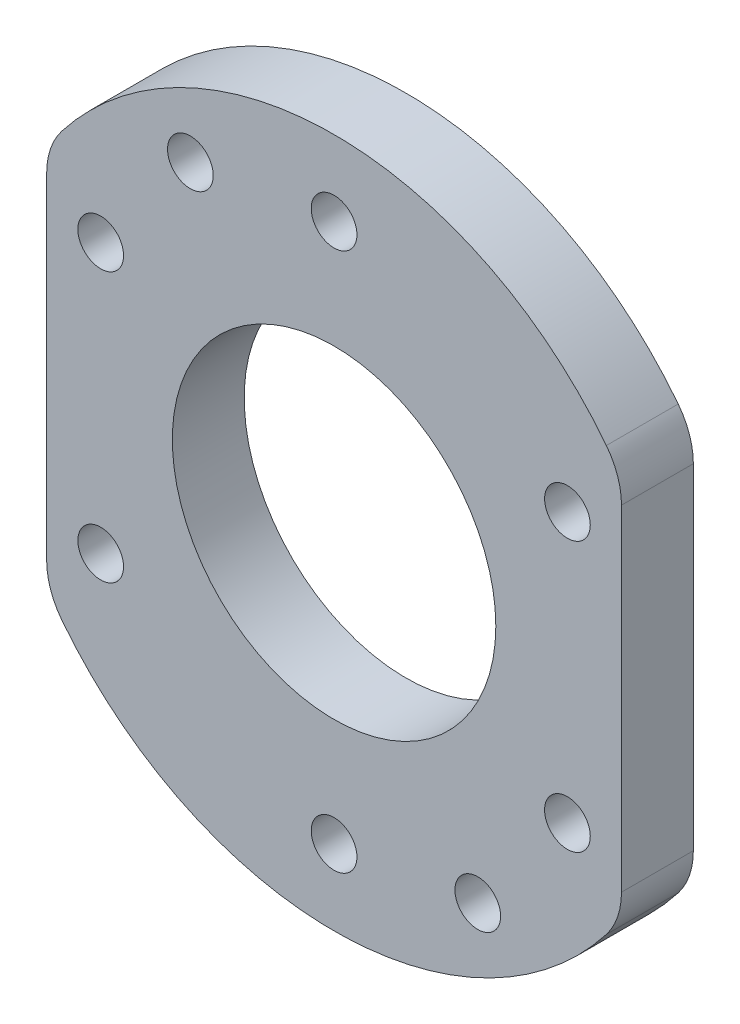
ISO-10303-21;
HEADER;
FILE_DESCRIPTION(('STEP AP214'),'2;1');
FILE_NAME('part.step','',(''),(''),'','','');
FILE_SCHEMA(('AUTOMOTIVE_DESIGN { 1 0 10303 214 1 1 1 1 }'));
ENDSEC;
DATA;
#1=APPLICATION_CONTEXT('core data for automotive mechanical design processes');
#2=APPLICATION_PROTOCOL_DEFINITION('international standard','automotive_design',2000,#1);
#3=PRODUCT_CONTEXT('',#1,'mechanical');
#4=PRODUCT('Part','Part','',(#3));
#5=PRODUCT_RELATED_PRODUCT_CATEGORY('part','',(#4));
#6=PRODUCT_DEFINITION_FORMATION('','',#4);
#7=PRODUCT_DEFINITION_CONTEXT('part definition',#1,'design');
#8=PRODUCT_DEFINITION('design','',#6,#7);
#9=PRODUCT_DEFINITION_SHAPE('','',#8);
#10=(LENGTH_UNIT() NAMED_UNIT(*) SI_UNIT(.MILLI.,.METRE.));
#11=(NAMED_UNIT(*) PLANE_ANGLE_UNIT() SI_UNIT($,.RADIAN.));
#12=(NAMED_UNIT(*) SI_UNIT($,.STERADIAN.) SOLID_ANGLE_UNIT());
#13=UNCERTAINTY_MEASURE_WITH_UNIT(LENGTH_MEASURE(1.E-05),#10,'distance_accuracy_value','');
#14=(GEOMETRIC_REPRESENTATION_CONTEXT(3) GLOBAL_UNCERTAINTY_ASSIGNED_CONTEXT((#13)) GLOBAL_UNIT_ASSIGNED_CONTEXT((#10,
#11,#12)) REPRESENTATION_CONTEXT('',''));
#15=CARTESIAN_POINT('',(0.,0.,0.));
#16=DIRECTION('',(0.,0.,1.));
#17=DIRECTION('',(1.,0.,0.));
#18=AXIS2_PLACEMENT_3D('',#15,#16,#17);
#19=CARTESIAN_POINT('',(25.4,0.,6.35));
#20=DIRECTION('',(1.,0.,0.));
#21=DIRECTION('',(0.,1.,0.));
#22=AXIS2_PLACEMENT_3D('',#19,#20,#21);
#23=PLANE('',#22);
#24=DIRECTION('',(0.,-1.,0.));
#25=VECTOR('',#24,1.);
#26=CARTESIAN_POINT('',(25.4,0.,0.));
#27=LINE('',#26,#25);
#28=CARTESIAN_POINT('',(25.4,14.8106178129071,0.));
#29=VERTEX_POINT('',#28);
#30=CARTESIAN_POINT('',(25.4,-14.8106178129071,0.));
#31=VERTEX_POINT('',#30);
#32=EDGE_CURVE('E130',#29,#31,#27,.T.);
#33=ORIENTED_EDGE('',*,*,#32,.F.);
#34=DIRECTION('',(0.,0.,1.));
#35=VECTOR('',#34,1.);
#36=CARTESIAN_POINT('',(25.4,14.8106178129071,6.35));
#37=LINE('',#36,#35);
#38=CARTESIAN_POINT('',(25.4,14.8106178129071,6.35));
#39=VERTEX_POINT('',#38);
#40=EDGE_CURVE('E108',#29,#39,#37,.T.);
#41=ORIENTED_EDGE('',*,*,#40,.T.);
#42=DIRECTION('',(0.,-1.,0.));
#43=VECTOR('',#42,1.);
#44=CARTESIAN_POINT('',(25.4,0.,6.35));
#45=LINE('',#44,#43);
#46=CARTESIAN_POINT('',(25.4,-14.8106178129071,6.35));
#47=VERTEX_POINT('',#46);
#48=EDGE_CURVE('E137',#39,#47,#45,.T.);
#49=ORIENTED_EDGE('',*,*,#48,.T.);
#50=DIRECTION('',(0.,0.,1.));
#51=VECTOR('',#50,1.);
#52=CARTESIAN_POINT('',(25.4,-14.8106178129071,0.));
#53=LINE('',#52,#51);
#54=EDGE_CURVE('E113',#47,#31,#53,.F.);
#55=ORIENTED_EDGE('',*,*,#54,.T.);
#56=EDGE_LOOP('',(#33,#41,#49,#55));
#57=FACE_BOUND('',#56,.T.);
#58=ADVANCED_FACE('F37',(#57),#23,.T.);
#59=CARTESIAN_POINT('',(0.,0.,6.35));
#60=DIRECTION('',(0.,0.,-1.));
#61=DIRECTION('',(-1.,0.,0.));
#62=AXIS2_PLACEMENT_3D('',#59,#60,#61);
#63=CYLINDRICAL_SURFACE('',#62,30.48);
#64=CARTESIAN_POINT('',(0.,0.,6.35));
#65=DIRECTION('',(0.,0.,1.));
#66=DIRECTION('',(1.,0.,0.));
#67=AXIS2_PLACEMENT_3D('',#64,#65,#66);
#68=CIRCLE('',#67,30.48);
#69=CARTESIAN_POINT('',(24.0631578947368,18.7081488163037,6.35));
#70=VERTEX_POINT('',#69);
#71=CARTESIAN_POINT('',(-24.0631578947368,18.7081488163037,6.35));
#72=VERTEX_POINT('',#71);
#73=EDGE_CURVE('E123',#70,#72,#68,.T.);
#74=ORIENTED_EDGE('',*,*,#73,.F.);
#75=DIRECTION('',(0.,0.,-1.));
#76=VECTOR('',#75,1.);
#77=CARTESIAN_POINT('',(24.0631578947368,18.7081488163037,6.35));
#78=LINE('',#77,#76);
#79=CARTESIAN_POINT('',(24.0631578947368,18.7081488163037,0.));
#80=VERTEX_POINT('',#79);
#81=EDGE_CURVE('E107',#70,#80,#78,.T.);
#82=ORIENTED_EDGE('',*,*,#81,.T.);
#83=CARTESIAN_POINT('',(0.,0.,0.));
#84=DIRECTION('',(0.,0.,1.));
#85=DIRECTION('',(1.,0.,0.));
#86=AXIS2_PLACEMENT_3D('',#83,#84,#85);
#87=CIRCLE('',#86,30.48);
#88=CARTESIAN_POINT('',(-24.0631578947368,18.7081488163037,0.));
#89=VERTEX_POINT('',#88);
#90=EDGE_CURVE('E120',#80,#89,#87,.T.);
#91=ORIENTED_EDGE('',*,*,#90,.T.);
#92=DIRECTION('',(0.,0.,-1.));
#93=VECTOR('',#92,1.);
#94=CARTESIAN_POINT('',(-24.0631578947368,18.7081488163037,6.35));
#95=LINE('',#94,#93);
#96=EDGE_CURVE('E125',#89,#72,#95,.F.);
#97=ORIENTED_EDGE('',*,*,#96,.T.);
#98=EDGE_LOOP('',(#74,#82,#91,#97));
#99=FACE_BOUND('',#98,.T.);
#100=ADVANCED_FACE('F119',(#99),#63,.T.);
#101=CARTESIAN_POINT('',(-25.4,0.,6.35));
#102=DIRECTION('',(1.,0.,0.));
#103=DIRECTION('',(0.,0.,-1.));
#104=AXIS2_PLACEMENT_3D('',#101,#102,#103);
#105=PLANE('',#104);
#106=DIRECTION('',(0.,-1.,0.));
#107=VECTOR('',#106,1.);
#108=CARTESIAN_POINT('',(-25.4,0.,0.));
#109=LINE('',#108,#107);
#110=CARTESIAN_POINT('',(-25.4,14.8106178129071,0.));
#111=VERTEX_POINT('',#110);
#112=CARTESIAN_POINT('',(-25.4,-14.8106178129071,0.));
#113=VERTEX_POINT('',#112);
#114=EDGE_CURVE('E129',#111,#113,#109,.T.);
#115=ORIENTED_EDGE('',*,*,#114,.T.);
#116=DIRECTION('',(0.,0.,-1.));
#117=VECTOR('',#116,1.);
#118=CARTESIAN_POINT('',(-25.4,-14.8106178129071,6.35));
#119=LINE('',#118,#117);
#120=CARTESIAN_POINT('',(-25.4,-14.8106178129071,6.35));
#121=VERTEX_POINT('',#120);
#122=EDGE_CURVE('E11',#113,#121,#119,.F.);
#123=ORIENTED_EDGE('',*,*,#122,.T.);
#124=DIRECTION('',(0.,-1.,0.));
#125=VECTOR('',#124,1.);
#126=CARTESIAN_POINT('',(-25.4,0.,6.35));
#127=LINE('',#126,#125);
#128=CARTESIAN_POINT('',(-25.4,14.8106178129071,6.35));
#129=VERTEX_POINT('',#128);
#130=EDGE_CURVE('E146',#129,#121,#127,.T.);
#131=ORIENTED_EDGE('',*,*,#130,.F.);
#132=DIRECTION('',(0.,0.,-1.));
#133=VECTOR('',#132,1.);
#134=CARTESIAN_POINT('',(-25.4,14.8106178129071,6.35));
#135=LINE('',#134,#133);
#136=EDGE_CURVE('E45',#129,#111,#135,.T.);
#137=ORIENTED_EDGE('',*,*,#136,.T.);
#138=EDGE_LOOP('',(#115,#123,#131,#137));
#139=FACE_BOUND('',#138,.T.);
#140=ADVANCED_FACE('F173',(#139),#105,.F.);
#141=CARTESIAN_POINT('',(-24.0631578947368,-18.7081488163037,0.));
#142=VERTEX_POINT('',#141);
#143=CARTESIAN_POINT('',(24.0631578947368,-18.7081488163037,0.));
#144=VERTEX_POINT('',#143);
#145=EDGE_CURVE('E132',#142,#144,#87,.T.);
#146=ORIENTED_EDGE('',*,*,#145,.T.);
#147=DIRECTION('',(0.,0.,-1.));
#148=VECTOR('',#147,1.);
#149=CARTESIAN_POINT('',(24.0631578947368,-18.7081488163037,6.35));
#150=LINE('',#149,#148);
#151=CARTESIAN_POINT('',(24.0631578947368,-18.7081488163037,6.35));
#152=VERTEX_POINT('',#151);
#153=EDGE_CURVE('E52',#144,#152,#150,.F.);
#154=ORIENTED_EDGE('',*,*,#153,.T.);
#155=CARTESIAN_POINT('',(-24.0631578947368,-18.7081488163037,6.35));
#156=VERTEX_POINT('',#155);
#157=EDGE_CURVE('E148',#156,#152,#68,.T.);
#158=ORIENTED_EDGE('',*,*,#157,.F.);
#159=DIRECTION('',(0.,0.,-1.));
#160=VECTOR('',#159,1.);
#161=CARTESIAN_POINT('',(-24.0631578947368,-18.7081488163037,6.35));
#162=LINE('',#161,#160);
#163=EDGE_CURVE('E163',#156,#142,#162,.T.);
#164=ORIENTED_EDGE('',*,*,#163,.T.);
#165=EDGE_LOOP('',(#146,#154,#158,#164));
#166=FACE_BOUND('',#165,.T.);
#167=ADVANCED_FACE('F197',(#166),#63,.T.);
#168=CARTESIAN_POINT('',(0.,0.,6.35));
#169=DIRECTION('',(0.,0.,1.));
#170=DIRECTION('',(1.,0.,0.));
#171=AXIS2_PLACEMENT_3D('',#168,#169,#170);
#172=PLANE('',#171);
#173=CARTESIAN_POINT('',(-12.7,21.9970452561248,6.35));
#174=DIRECTION('',(0.,0.,1.));
#175=DIRECTION('',(1.,0.,0.));
#176=AXIS2_PLACEMENT_3D('',#173,#174,#175);
#177=CIRCLE('',#176,2.01929999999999);
#178=CARTESIAN_POINT('',(-10.6807,21.9970452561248,6.35));
#179=VERTEX_POINT('',#178);
#180=EDGE_CURVE('E250',#179,#179,#177,.T.);
#181=ORIENTED_EDGE('',*,*,#180,.F.);
#182=EDGE_LOOP('',(#181));
#183=FACE_BOUND('',#182,.T.);
#184=CARTESIAN_POINT('',(12.7,-21.9970452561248,6.35));
#185=DIRECTION('',(0.,0.,1.));
#186=DIRECTION('',(1.,0.,0.));
#187=AXIS2_PLACEMENT_3D('',#184,#185,#186);
#188=CIRCLE('',#187,2.01929999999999);
#189=CARTESIAN_POINT('',(14.7192999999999,-21.9970452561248,6.35));
#190=VERTEX_POINT('',#189);
#191=EDGE_CURVE('E252',#190,#190,#188,.T.);
#192=ORIENTED_EDGE('',*,*,#191,.F.);
#193=EDGE_LOOP('',(#192));
#194=FACE_BOUND('',#193,.T.);
#195=CARTESIAN_POINT('',(0.,0.,6.35));
#196=DIRECTION('',(0.,0.,1.));
#197=DIRECTION('',(1.,0.,0.));
#198=AXIS2_PLACEMENT_3D('',#195,#196,#197);
#199=CIRCLE('',#198,14.29385);
#200=CARTESIAN_POINT('',(14.29385,0.,6.35));
#201=VERTEX_POINT('',#200);
#202=EDGE_CURVE('E260',#201,#201,#199,.T.);
#203=ORIENTED_EDGE('',*,*,#202,.F.);
#204=EDGE_LOOP('',(#203));
#205=FACE_BOUND('',#204,.T.);
#206=CARTESIAN_POINT('',(-20.6222299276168,11.9062500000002,6.35));
#207=DIRECTION('',(0.,0.,1.));
#208=DIRECTION('',(1.,0.,0.));
#209=AXIS2_PLACEMENT_3D('',#206,#207,#208);
#210=CIRCLE('',#209,2.01929999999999);
#211=CARTESIAN_POINT('',(-18.6029299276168,11.9062500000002,6.35));
#212=VERTEX_POINT('',#211);
#213=EDGE_CURVE('E264',#212,#212,#210,.T.);
#214=ORIENTED_EDGE('',*,*,#213,.F.);
#215=EDGE_LOOP('',(#214));
#216=FACE_BOUND('',#215,.T.);
#217=CARTESIAN_POINT('',(-20.6222299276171,-11.9062499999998,6.35));
#218=DIRECTION('',(0.,0.,1.));
#219=DIRECTION('',(1.,0.,0.));
#220=AXIS2_PLACEMENT_3D('',#217,#218,#219);
#221=CIRCLE('',#220,2.01929999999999);
#222=CARTESIAN_POINT('',(-18.6029299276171,-11.9062499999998,6.35));
#223=VERTEX_POINT('',#222);
#224=EDGE_CURVE('E272',#223,#223,#221,.T.);
#225=ORIENTED_EDGE('',*,*,#224,.F.);
#226=EDGE_LOOP('',(#225));
#227=FACE_BOUND('',#226,.T.);
#228=CARTESIAN_POINT('',(0.,-23.8125,6.35));
#229=DIRECTION('',(0.,0.,1.));
#230=DIRECTION('',(1.,0.,0.));
#231=AXIS2_PLACEMENT_3D('',#228,#229,#230);
#232=CIRCLE('',#231,2.01929999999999);
#233=CARTESIAN_POINT('',(2.01929999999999,-23.8125,6.35));
#234=VERTEX_POINT('',#233);
#235=EDGE_CURVE('E278',#234,#234,#232,.T.);
#236=ORIENTED_EDGE('',*,*,#235,.F.);
#237=EDGE_LOOP('',(#236));
#238=FACE_BOUND('',#237,.T.);
#239=CARTESIAN_POINT('',(20.6222299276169,-11.9062500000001,6.35));
#240=DIRECTION('',(0.,0.,1.));
#241=DIRECTION('',(1.,0.,0.));
#242=AXIS2_PLACEMENT_3D('',#239,#240,#241);
#243=CIRCLE('',#242,2.01929999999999);
#244=CARTESIAN_POINT('',(22.6415299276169,-11.9062500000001,6.35));
#245=VERTEX_POINT('',#244);
#246=EDGE_CURVE('E284',#245,#245,#243,.T.);
#247=ORIENTED_EDGE('',*,*,#246,.F.);
#248=EDGE_LOOP('',(#247));
#249=FACE_BOUND('',#248,.T.);
#250=CARTESIAN_POINT('',(20.622229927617,11.90625,6.35));
#251=DIRECTION('',(0.,0.,1.));
#252=DIRECTION('',(1.,0.,0.));
#253=AXIS2_PLACEMENT_3D('',#250,#251,#252);
#254=CIRCLE('',#253,2.01929999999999);
#255=CARTESIAN_POINT('',(22.641529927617,11.90625,6.35));
#256=VERTEX_POINT('',#255);
#257=EDGE_CURVE('E290',#256,#256,#254,.T.);
#258=ORIENTED_EDGE('',*,*,#257,.F.);
#259=EDGE_LOOP('',(#258));
#260=FACE_BOUND('',#259,.T.);
#261=CARTESIAN_POINT('',(0.,23.8125,6.35));
#262=DIRECTION('',(0.,0.,1.));
#263=DIRECTION('',(1.,0.,0.));
#264=AXIS2_PLACEMENT_3D('',#261,#262,#263);
#265=CIRCLE('',#264,2.01929999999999);
#266=CARTESIAN_POINT('',(2.01929999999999,23.8125,6.35));
#267=VERTEX_POINT('',#266);
#268=EDGE_CURVE('E295',#267,#267,#265,.T.);
#269=ORIENTED_EDGE('',*,*,#268,.F.);
#270=EDGE_LOOP('',(#269));
#271=FACE_BOUND('',#270,.T.);
#272=ORIENTED_EDGE('',*,*,#48,.F.);
#273=CARTESIAN_POINT('',(19.05,14.8106178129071,6.35));
#274=DIRECTION('',(0.,0.,1.));
#275=DIRECTION('',(1.,0.,0.));
#276=AXIS2_PLACEMENT_3D('',#273,#274,#275);
#277=CIRCLE('',#276,6.35);
#278=EDGE_CURVE('E166',#39,#70,#277,.T.);
#279=ORIENTED_EDGE('',*,*,#278,.T.);
#280=ORIENTED_EDGE('',*,*,#73,.T.);
#281=CARTESIAN_POINT('',(-19.05,14.8106178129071,6.35));
#282=DIRECTION('',(0.,0.,1.));
#283=DIRECTION('',(1.,0.,0.));
#284=AXIS2_PLACEMENT_3D('',#281,#282,#283);
#285=CIRCLE('',#284,6.35);
#286=EDGE_CURVE('E155',#72,#129,#285,.T.);
#287=ORIENTED_EDGE('',*,*,#286,.T.);
#288=ORIENTED_EDGE('',*,*,#130,.T.);
#289=CARTESIAN_POINT('',(-19.05,-14.8106178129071,6.35));
#290=DIRECTION('',(0.,0.,1.));
#291=DIRECTION('',(1.,0.,0.));
#292=AXIS2_PLACEMENT_3D('',#289,#290,#291);
#293=CIRCLE('',#292,6.35);
#294=EDGE_CURVE('E59',#121,#156,#293,.T.);
#295=ORIENTED_EDGE('',*,*,#294,.T.);
#296=ORIENTED_EDGE('',*,*,#157,.T.);
#297=CARTESIAN_POINT('',(19.05,-14.8106178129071,6.35));
#298=DIRECTION('',(0.,0.,1.));
#299=DIRECTION('',(1.,0.,0.));
#300=AXIS2_PLACEMENT_3D('',#297,#298,#299);
#301=CIRCLE('',#300,6.35);
#302=EDGE_CURVE('E164',#152,#47,#301,.T.);
#303=ORIENTED_EDGE('',*,*,#302,.T.);
#304=EDGE_LOOP('',(#272,#279,#280,#287,#288,#295,#296,#303));
#305=FACE_BOUND('',#304,.T.);
#306=ADVANCED_FACE('F153',(#183,#194,#205,#216,#227,#238,#249,#260,#271,#305),#172,.T.);
#307=CARTESIAN_POINT('',(0.,0.,0.));
#308=DIRECTION('',(0.,0.,1.));
#309=DIRECTION('',(1.,0.,0.));
#310=AXIS2_PLACEMENT_3D('',#307,#308,#309);
#311=PLANE('',#310);
#312=CARTESIAN_POINT('',(-12.7,21.9970452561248,0.));
#313=DIRECTION('',(0.,0.,1.));
#314=DIRECTION('',(1.,0.,0.));
#315=AXIS2_PLACEMENT_3D('',#312,#313,#314);
#316=CIRCLE('',#315,2.0193);
#317=CARTESIAN_POINT('',(-10.6807,21.9970452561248,0.));
#318=VERTEX_POINT('',#317);
#319=EDGE_CURVE('E247',#318,#318,#316,.T.);
#320=ORIENTED_EDGE('',*,*,#319,.T.);
#321=EDGE_LOOP('',(#320));
#322=FACE_BOUND('',#321,.T.);
#323=CARTESIAN_POINT('',(12.7,-21.9970452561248,0.));
#324=DIRECTION('',(0.,0.,1.));
#325=DIRECTION('',(1.,0.,0.));
#326=AXIS2_PLACEMENT_3D('',#323,#324,#325);
#327=CIRCLE('',#326,2.0193);
#328=CARTESIAN_POINT('',(14.7193,-21.9970452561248,0.));
#329=VERTEX_POINT('',#328);
#330=EDGE_CURVE('E257',#329,#329,#327,.T.);
#331=ORIENTED_EDGE('',*,*,#330,.T.);
#332=EDGE_LOOP('',(#331));
#333=FACE_BOUND('',#332,.T.);
#334=CARTESIAN_POINT('',(0.,0.,0.));
#335=DIRECTION('',(0.,0.,1.));
#336=DIRECTION('',(1.,0.,0.));
#337=AXIS2_PLACEMENT_3D('',#334,#335,#336);
#338=CIRCLE('',#337,14.29385);
#339=CARTESIAN_POINT('',(14.29385,0.,0.));
#340=VERTEX_POINT('',#339);
#341=EDGE_CURVE('E261',#340,#340,#338,.T.);
#342=ORIENTED_EDGE('',*,*,#341,.T.);
#343=EDGE_LOOP('',(#342));
#344=FACE_BOUND('',#343,.T.);
#345=CARTESIAN_POINT('',(-20.6222299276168,11.9062500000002,0.));
#346=DIRECTION('',(0.,0.,1.));
#347=DIRECTION('',(1.,0.,0.));
#348=AXIS2_PLACEMENT_3D('',#345,#346,#347);
#349=CIRCLE('',#348,2.0193);
#350=CARTESIAN_POINT('',(-18.6029299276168,11.9062500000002,0.));
#351=VERTEX_POINT('',#350);
#352=EDGE_CURVE('E269',#351,#351,#349,.T.);
#353=ORIENTED_EDGE('',*,*,#352,.T.);
#354=EDGE_LOOP('',(#353));
#355=FACE_BOUND('',#354,.T.);
#356=CARTESIAN_POINT('',(-20.6222299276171,-11.9062499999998,0.));
#357=DIRECTION('',(0.,0.,1.));
#358=DIRECTION('',(1.,0.,0.));
#359=AXIS2_PLACEMENT_3D('',#356,#357,#358);
#360=CIRCLE('',#359,2.0193);
#361=CARTESIAN_POINT('',(-18.6029299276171,-11.9062499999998,0.));
#362=VERTEX_POINT('',#361);
#363=EDGE_CURVE('E275',#362,#362,#360,.T.);
#364=ORIENTED_EDGE('',*,*,#363,.T.);
#365=EDGE_LOOP('',(#364));
#366=FACE_BOUND('',#365,.T.);
#367=CARTESIAN_POINT('',(0.,-23.8125,0.));
#368=DIRECTION('',(0.,0.,1.));
#369=DIRECTION('',(1.,0.,0.));
#370=AXIS2_PLACEMENT_3D('',#367,#368,#369);
#371=CIRCLE('',#370,2.0193);
#372=CARTESIAN_POINT('',(2.0193,-23.8125,0.));
#373=VERTEX_POINT('',#372);
#374=EDGE_CURVE('E281',#373,#373,#371,.T.);
#375=ORIENTED_EDGE('',*,*,#374,.T.);
#376=EDGE_LOOP('',(#375));
#377=FACE_BOUND('',#376,.T.);
#378=CARTESIAN_POINT('',(20.6222299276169,-11.9062500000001,0.));
#379=DIRECTION('',(0.,0.,1.));
#380=DIRECTION('',(1.,0.,0.));
#381=AXIS2_PLACEMENT_3D('',#378,#379,#380);
#382=CIRCLE('',#381,2.0193);
#383=CARTESIAN_POINT('',(22.6415299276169,-11.9062500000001,0.));
#384=VERTEX_POINT('',#383);
#385=EDGE_CURVE('E287',#384,#384,#382,.T.);
#386=ORIENTED_EDGE('',*,*,#385,.T.);
#387=EDGE_LOOP('',(#386));
#388=FACE_BOUND('',#387,.T.);
#389=CARTESIAN_POINT('',(20.622229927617,11.90625,0.));
#390=DIRECTION('',(0.,0.,1.));
#391=DIRECTION('',(1.,0.,0.));
#392=AXIS2_PLACEMENT_3D('',#389,#390,#391);
#393=CIRCLE('',#392,2.0193);
#394=CARTESIAN_POINT('',(22.641529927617,11.90625,0.));
#395=VERTEX_POINT('',#394);
#396=EDGE_CURVE('E293',#395,#395,#393,.T.);
#397=ORIENTED_EDGE('',*,*,#396,.T.);
#398=EDGE_LOOP('',(#397));
#399=FACE_BOUND('',#398,.T.);
#400=CARTESIAN_POINT('',(0.,23.8125,0.));
#401=DIRECTION('',(0.,0.,1.));
#402=DIRECTION('',(1.,0.,0.));
#403=AXIS2_PLACEMENT_3D('',#400,#401,#402);
#404=CIRCLE('',#403,2.0193);
#405=CARTESIAN_POINT('',(2.0193,23.8125,0.));
#406=VERTEX_POINT('',#405);
#407=EDGE_CURVE('E135',#406,#406,#404,.T.);
#408=ORIENTED_EDGE('',*,*,#407,.T.);
#409=EDGE_LOOP('',(#408));
#410=FACE_BOUND('',#409,.T.);
#411=ORIENTED_EDGE('',*,*,#90,.F.);
#412=CARTESIAN_POINT('',(19.05,14.8106178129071,0.));
#413=DIRECTION('',(0.,0.,1.));
#414=DIRECTION('',(1.,0.,0.));
#415=AXIS2_PLACEMENT_3D('',#412,#413,#414);
#416=CIRCLE('',#415,6.35);
#417=EDGE_CURVE('E103',#80,#29,#416,.F.);
#418=ORIENTED_EDGE('',*,*,#417,.T.);
#419=ORIENTED_EDGE('',*,*,#32,.T.);
#420=CARTESIAN_POINT('',(19.05,-14.8106178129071,0.));
#421=DIRECTION('',(0.,0.,1.));
#422=DIRECTION('',(1.,0.,0.));
#423=AXIS2_PLACEMENT_3D('',#420,#421,#422);
#424=CIRCLE('',#423,6.35);
#425=EDGE_CURVE('E114',#31,#144,#424,.F.);
#426=ORIENTED_EDGE('',*,*,#425,.T.);
#427=ORIENTED_EDGE('',*,*,#145,.F.);
#428=CARTESIAN_POINT('',(-19.05,-14.8106178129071,0.));
#429=DIRECTION('',(0.,0.,1.));
#430=DIRECTION('',(1.,0.,0.));
#431=AXIS2_PLACEMENT_3D('',#428,#429,#430);
#432=CIRCLE('',#431,6.35);
#433=EDGE_CURVE('E175',#142,#113,#432,.F.);
#434=ORIENTED_EDGE('',*,*,#433,.T.);
#435=ORIENTED_EDGE('',*,*,#114,.F.);
#436=CARTESIAN_POINT('',(-19.05,14.8106178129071,0.));
#437=DIRECTION('',(0.,0.,1.));
#438=DIRECTION('',(1.,0.,0.));
#439=AXIS2_PLACEMENT_3D('',#436,#437,#438);
#440=CIRCLE('',#439,6.35);
#441=EDGE_CURVE('E124',#111,#89,#440,.F.);
#442=ORIENTED_EDGE('',*,*,#441,.T.);
#443=EDGE_LOOP('',(#411,#418,#419,#426,#427,#434,#435,#442));
#444=FACE_BOUND('',#443,.T.);
#445=ADVANCED_FACE('F127',(#322,#333,#344,#355,#366,#377,#388,#399,#410,#444),#311,.F.);
#446=CARTESIAN_POINT('',(0.,23.8125,6.35));
#447=DIRECTION('',(0.,0.,1.));
#448=DIRECTION('',(1.,0.,0.));
#449=AXIS2_PLACEMENT_3D('',#446,#447,#448);
#450=CYLINDRICAL_SURFACE('',#449,2.01929999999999);
#451=ORIENTED_EDGE('',*,*,#407,.F.);
#452=EDGE_LOOP('',(#451));
#453=FACE_BOUND('',#452,.T.);
#454=ORIENTED_EDGE('',*,*,#268,.T.);
#455=EDGE_LOOP('',(#454));
#456=FACE_BOUND('',#455,.T.);
#457=ADVANCED_FACE('F204',(#453,#456),#450,.F.);
#458=CARTESIAN_POINT('',(20.622229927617,11.90625,6.35));
#459=DIRECTION('',(0.,0.,1.));
#460=DIRECTION('',(1.,0.,0.));
#461=AXIS2_PLACEMENT_3D('',#458,#459,#460);
#462=CYLINDRICAL_SURFACE('',#461,2.01929999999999);
#463=ORIENTED_EDGE('',*,*,#396,.F.);
#464=EDGE_LOOP('',(#463));
#465=FACE_BOUND('',#464,.T.);
#466=ORIENTED_EDGE('',*,*,#257,.T.);
#467=EDGE_LOOP('',(#466));
#468=FACE_BOUND('',#467,.T.);
#469=ADVANCED_FACE('F211',(#465,#468),#462,.F.);
#470=CARTESIAN_POINT('',(20.6222299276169,-11.9062500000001,6.35));
#471=DIRECTION('',(0.,0.,1.));
#472=DIRECTION('',(1.,0.,0.));
#473=AXIS2_PLACEMENT_3D('',#470,#471,#472);
#474=CYLINDRICAL_SURFACE('',#473,2.01929999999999);
#475=ORIENTED_EDGE('',*,*,#385,.F.);
#476=EDGE_LOOP('',(#475));
#477=FACE_BOUND('',#476,.T.);
#478=ORIENTED_EDGE('',*,*,#246,.T.);
#479=EDGE_LOOP('',(#478));
#480=FACE_BOUND('',#479,.T.);
#481=ADVANCED_FACE('F215',(#477,#480),#474,.F.);
#482=CARTESIAN_POINT('',(0.,-23.8125,6.35));
#483=DIRECTION('',(0.,0.,1.));
#484=DIRECTION('',(1.,0.,0.));
#485=AXIS2_PLACEMENT_3D('',#482,#483,#484);
#486=CYLINDRICAL_SURFACE('',#485,2.01929999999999);
#487=ORIENTED_EDGE('',*,*,#374,.F.);
#488=EDGE_LOOP('',(#487));
#489=FACE_BOUND('',#488,.T.);
#490=ORIENTED_EDGE('',*,*,#235,.T.);
#491=EDGE_LOOP('',(#490));
#492=FACE_BOUND('',#491,.T.);
#493=ADVANCED_FACE('F219',(#489,#492),#486,.F.);
#494=CARTESIAN_POINT('',(-20.6222299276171,-11.9062499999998,6.35));
#495=DIRECTION('',(0.,0.,1.));
#496=DIRECTION('',(1.,0.,0.));
#497=AXIS2_PLACEMENT_3D('',#494,#495,#496);
#498=CYLINDRICAL_SURFACE('',#497,2.01929999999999);
#499=ORIENTED_EDGE('',*,*,#363,.F.);
#500=EDGE_LOOP('',(#499));
#501=FACE_BOUND('',#500,.T.);
#502=ORIENTED_EDGE('',*,*,#224,.T.);
#503=EDGE_LOOP('',(#502));
#504=FACE_BOUND('',#503,.T.);
#505=ADVANCED_FACE('F223',(#501,#504),#498,.F.);
#506=CARTESIAN_POINT('',(-20.6222299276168,11.9062500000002,6.35));
#507=DIRECTION('',(0.,0.,1.));
#508=DIRECTION('',(1.,0.,0.));
#509=AXIS2_PLACEMENT_3D('',#506,#507,#508);
#510=CYLINDRICAL_SURFACE('',#509,2.01929999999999);
#511=ORIENTED_EDGE('',*,*,#352,.F.);
#512=EDGE_LOOP('',(#511));
#513=FACE_BOUND('',#512,.T.);
#514=ORIENTED_EDGE('',*,*,#213,.T.);
#515=EDGE_LOOP('',(#514));
#516=FACE_BOUND('',#515,.T.);
#517=ADVANCED_FACE('F189',(#513,#516),#510,.F.);
#518=CARTESIAN_POINT('',(19.05,14.8106178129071,6.35));
#519=DIRECTION('',(0.,0.,-1.));
#520=DIRECTION('',(-1.,0.,0.));
#521=AXIS2_PLACEMENT_3D('',#518,#519,#520);
#522=CYLINDRICAL_SURFACE('',#521,6.35);
#523=ORIENTED_EDGE('',*,*,#278,.F.);
#524=ORIENTED_EDGE('',*,*,#40,.F.);
#525=ORIENTED_EDGE('',*,*,#417,.F.);
#526=ORIENTED_EDGE('',*,*,#81,.F.);
#527=EDGE_LOOP('',(#523,#524,#525,#526));
#528=FACE_BOUND('',#527,.T.);
#529=ADVANCED_FACE('F106',(#528),#522,.T.);
#530=CARTESIAN_POINT('',(19.05,-14.8106178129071,6.35));
#531=DIRECTION('',(0.,0.,-1.));
#532=DIRECTION('',(-1.,0.,0.));
#533=AXIS2_PLACEMENT_3D('',#530,#531,#532);
#534=CYLINDRICAL_SURFACE('',#533,6.35);
#535=ORIENTED_EDGE('',*,*,#302,.F.);
#536=ORIENTED_EDGE('',*,*,#153,.F.);
#537=ORIENTED_EDGE('',*,*,#425,.F.);
#538=ORIENTED_EDGE('',*,*,#54,.F.);
#539=EDGE_LOOP('',(#535,#536,#537,#538));
#540=FACE_BOUND('',#539,.T.);
#541=ADVANCED_FACE('F182',(#540),#534,.T.);
#542=CARTESIAN_POINT('',(-19.05,-14.8106178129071,6.35));
#543=DIRECTION('',(0.,0.,-1.));
#544=DIRECTION('',(-1.,0.,0.));
#545=AXIS2_PLACEMENT_3D('',#542,#543,#544);
#546=CYLINDRICAL_SURFACE('',#545,6.35);
#547=ORIENTED_EDGE('',*,*,#294,.F.);
#548=ORIENTED_EDGE('',*,*,#122,.F.);
#549=ORIENTED_EDGE('',*,*,#433,.F.);
#550=ORIENTED_EDGE('',*,*,#163,.F.);
#551=EDGE_LOOP('',(#547,#548,#549,#550));
#552=FACE_BOUND('',#551,.T.);
#553=ADVANCED_FACE('F162',(#552),#546,.T.);
#554=CARTESIAN_POINT('',(-19.05,14.8106178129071,6.35));
#555=DIRECTION('',(0.,0.,-1.));
#556=DIRECTION('',(-1.,0.,0.));
#557=AXIS2_PLACEMENT_3D('',#554,#555,#556);
#558=CYLINDRICAL_SURFACE('',#557,6.35);
#559=ORIENTED_EDGE('',*,*,#286,.F.);
#560=ORIENTED_EDGE('',*,*,#96,.F.);
#561=ORIENTED_EDGE('',*,*,#441,.F.);
#562=ORIENTED_EDGE('',*,*,#136,.F.);
#563=EDGE_LOOP('',(#559,#560,#561,#562));
#564=FACE_BOUND('',#563,.T.);
#565=ADVANCED_FACE('F39',(#564),#558,.T.);
#566=CARTESIAN_POINT('',(0.,0.,0.));
#567=DIRECTION('',(0.,0.,1.));
#568=DIRECTION('',(1.,0.,0.));
#569=AXIS2_PLACEMENT_3D('',#566,#567,#568);
#570=CYLINDRICAL_SURFACE('',#569,14.29385);
#571=ORIENTED_EDGE('',*,*,#341,.F.);
#572=EDGE_LOOP('',(#571));
#573=FACE_BOUND('',#572,.T.);
#574=ORIENTED_EDGE('',*,*,#202,.T.);
#575=EDGE_LOOP('',(#574));
#576=FACE_BOUND('',#575,.T.);
#577=ADVANCED_FACE('F231',(#573,#576),#570,.F.);
#578=CARTESIAN_POINT('',(12.7,-21.9970452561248,6.35));
#579=DIRECTION('',(0.,0.,1.));
#580=DIRECTION('',(1.,0.,0.));
#581=AXIS2_PLACEMENT_3D('',#578,#579,#580);
#582=CYLINDRICAL_SURFACE('',#581,2.01929999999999);
#583=ORIENTED_EDGE('',*,*,#330,.F.);
#584=EDGE_LOOP('',(#583));
#585=FACE_BOUND('',#584,.T.);
#586=ORIENTED_EDGE('',*,*,#191,.T.);
#587=EDGE_LOOP('',(#586));
#588=FACE_BOUND('',#587,.T.);
#589=ADVANCED_FACE('F234',(#585,#588),#582,.F.);
#590=CARTESIAN_POINT('',(-12.7,21.9970452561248,6.35));
#591=DIRECTION('',(0.,0.,1.));
#592=DIRECTION('',(1.,0.,0.));
#593=AXIS2_PLACEMENT_3D('',#590,#591,#592);
#594=CYLINDRICAL_SURFACE('',#593,2.01929999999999);
#595=ORIENTED_EDGE('',*,*,#319,.F.);
#596=EDGE_LOOP('',(#595));
#597=FACE_BOUND('',#596,.T.);
#598=ORIENTED_EDGE('',*,*,#180,.T.);
#599=EDGE_LOOP('',(#598));
#600=FACE_BOUND('',#599,.T.);
#601=ADVANCED_FACE('F238',(#597,#600),#594,.F.);
#602=CLOSED_SHELL('',(#58,#100,#140,#167,#306,#445,#457,#469,#481,#493,#505,#517,#529,#541,#553,
#565,#577,#589,#601));
#603=MANIFOLD_SOLID_BREP('B2',#602);
#604=ADVANCED_BREP_SHAPE_REPRESENTATION('',(#18,#603),#14);
#605=SHAPE_DEFINITION_REPRESENTATION(#9,#604);
ENDSEC;
END-ISO-10303-21;
